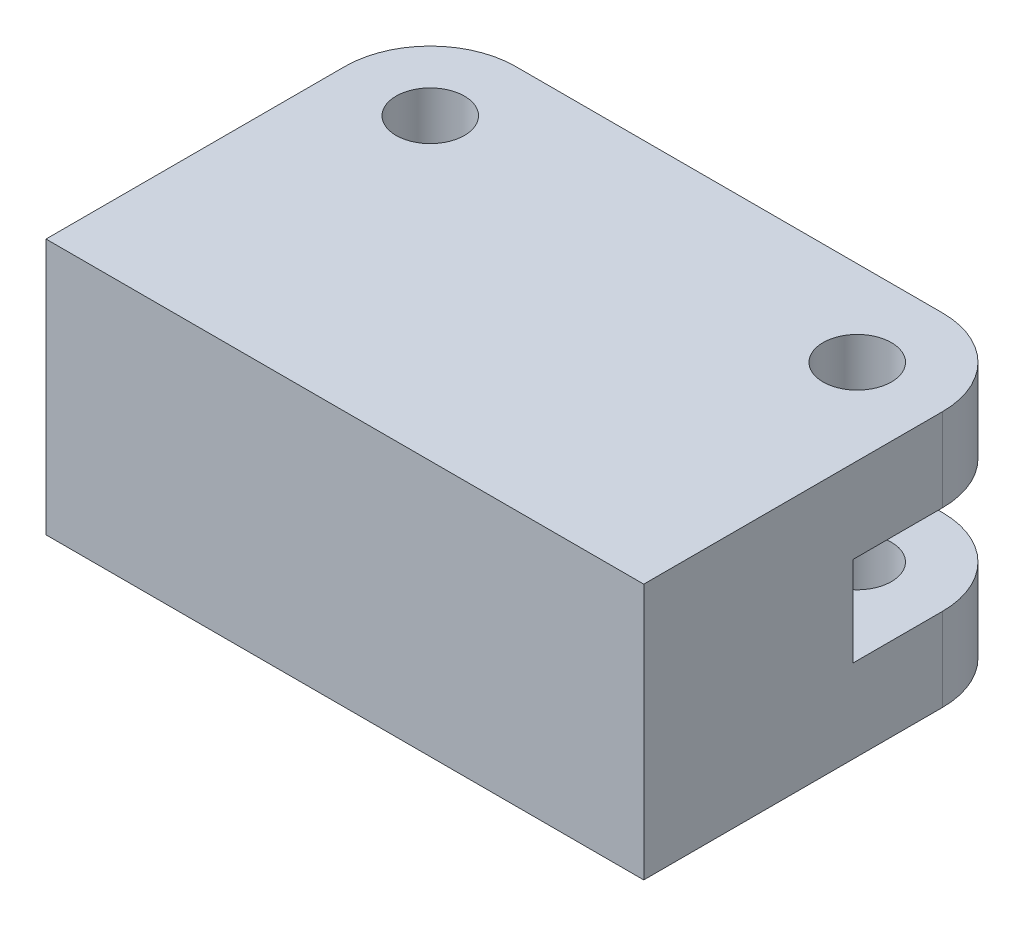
ISO-10303-21;
HEADER;
FILE_DESCRIPTION(('STEP AP214'),'2;1');
FILE_NAME('part.step','',(''),(''),'','','');
FILE_SCHEMA(('AUTOMOTIVE_DESIGN { 1 0 10303 214 1 1 1 1 }'));
ENDSEC;
DATA;
#1=APPLICATION_CONTEXT('core data for automotive mechanical design processes');
#2=APPLICATION_PROTOCOL_DEFINITION('international standard','automotive_design',2000,#1);
#3=PRODUCT_CONTEXT('',#1,'mechanical');
#4=PRODUCT('Part','Part','',(#3));
#5=PRODUCT_RELATED_PRODUCT_CATEGORY('part','',(#4));
#6=PRODUCT_DEFINITION_FORMATION('','',#4);
#7=PRODUCT_DEFINITION_CONTEXT('part definition',#1,'design');
#8=PRODUCT_DEFINITION('design','',#6,#7);
#9=PRODUCT_DEFINITION_SHAPE('','',#8);
#10=(LENGTH_UNIT() NAMED_UNIT(*) SI_UNIT(.MILLI.,.METRE.));
#11=(NAMED_UNIT(*) PLANE_ANGLE_UNIT() SI_UNIT($,.RADIAN.));
#12=(NAMED_UNIT(*) SI_UNIT($,.STERADIAN.) SOLID_ANGLE_UNIT());
#13=UNCERTAINTY_MEASURE_WITH_UNIT(LENGTH_MEASURE(1.E-05),#10,'distance_accuracy_value','');
#14=(GEOMETRIC_REPRESENTATION_CONTEXT(3) GLOBAL_UNCERTAINTY_ASSIGNED_CONTEXT((#13)) GLOBAL_UNIT_ASSIGNED_CONTEXT((#10,
#11,#12)) REPRESENTATION_CONTEXT('',''));
#15=CARTESIAN_POINT('',(0.,0.,0.));
#16=DIRECTION('',(0.,0.,1.));
#17=DIRECTION('',(1.,0.,0.));
#18=AXIS2_PLACEMENT_3D('',#15,#16,#17);
#19=CARTESIAN_POINT('',(0.,12.,0.));
#20=DIRECTION('',(0.,0.,1.));
#21=DIRECTION('',(1.,0.,0.));
#22=AXIS2_PLACEMENT_3D('',#19,#20,#21);
#23=PLANE('',#22);
#24=DIRECTION('',(-1.,0.,0.));
#25=VECTOR('',#24,1.);
#26=CARTESIAN_POINT('',(0.,12.,0.));
#27=LINE('',#26,#25);
#28=CARTESIAN_POINT('',(24.,12.,0.));
#29=VERTEX_POINT('',#28);
#30=CARTESIAN_POINT('',(4.,12.,0.));
#31=VERTEX_POINT('',#30);
#32=EDGE_CURVE('E192',#29,#31,#27,.T.);
#33=ORIENTED_EDGE('',*,*,#32,.F.);
#34=DIRECTION('',(0.,-1.,0.));
#35=VECTOR('',#34,1.);
#36=CARTESIAN_POINT('',(24.,12.,0.));
#37=LINE('',#36,#35);
#38=CARTESIAN_POINT('',(24.,8.1,0.));
#39=VERTEX_POINT('',#38);
#40=EDGE_CURVE('E230',#29,#39,#37,.T.);
#41=ORIENTED_EDGE('',*,*,#40,.T.);
#42=DIRECTION('',(1.,0.,0.));
#43=VECTOR('',#42,1.);
#44=CARTESIAN_POINT('',(28.,8.1,0.));
#45=LINE('',#44,#43);
#46=CARTESIAN_POINT('',(4.00000000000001,8.1,0.));
#47=VERTEX_POINT('',#46);
#48=EDGE_CURVE('E151',#47,#39,#45,.T.);
#49=ORIENTED_EDGE('',*,*,#48,.F.);
#50=DIRECTION('',(0.,-1.,0.));
#51=VECTOR('',#50,1.);
#52=CARTESIAN_POINT('',(4.,12.,0.));
#53=LINE('',#52,#51);
#54=EDGE_CURVE('E228',#47,#31,#53,.F.);
#55=ORIENTED_EDGE('',*,*,#54,.T.);
#56=EDGE_LOOP('',(#33,#41,#49,#55));
#57=FACE_BOUND('',#56,.T.);
#58=ADVANCED_FACE('F41',(#57),#23,.F.);
#59=CARTESIAN_POINT('',(4.,12.,4.));
#60=DIRECTION('',(0.,-1.,0.));
#61=DIRECTION('',(0.,0.,-1.));
#62=AXIS2_PLACEMENT_3D('',#59,#60,#61);
#63=CYLINDRICAL_SURFACE('',#62,1.6);
#64=CARTESIAN_POINT('',(4.,8.1,4.));
#65=DIRECTION('',(0.,1.,0.));
#66=DIRECTION('',(0.,0.,1.));
#67=AXIS2_PLACEMENT_3D('',#64,#65,#66);
#68=CIRCLE('',#67,1.6);
#69=CARTESIAN_POINT('',(4.,8.1,5.6));
#70=VERTEX_POINT('',#69);
#71=EDGE_CURVE('E168',#70,#70,#68,.T.);
#72=ORIENTED_EDGE('',*,*,#71,.F.);
#73=EDGE_LOOP('',(#72));
#74=FACE_BOUND('',#73,.T.);
#75=CARTESIAN_POINT('',(4.,12.,4.));
#76=DIRECTION('',(0.,1.,0.));
#77=DIRECTION('',(0.,0.,1.));
#78=AXIS2_PLACEMENT_3D('',#75,#76,#77);
#79=CIRCLE('',#78,1.6);
#80=CARTESIAN_POINT('',(4.,12.,5.6));
#81=VERTEX_POINT('',#80);
#82=EDGE_CURVE('E178',#81,#81,#79,.T.);
#83=ORIENTED_EDGE('',*,*,#82,.T.);
#84=EDGE_LOOP('',(#83));
#85=FACE_BOUND('',#84,.T.);
#86=ADVANCED_FACE('F291',(#74,#85),#63,.F.);
#87=CARTESIAN_POINT('',(24.,12.,4.));
#88=DIRECTION('',(0.,-1.,0.));
#89=DIRECTION('',(0.,0.,-1.));
#90=AXIS2_PLACEMENT_3D('',#87,#88,#89);
#91=CYLINDRICAL_SURFACE('',#90,1.6);
#92=CARTESIAN_POINT('',(24.,8.1,4.));
#93=DIRECTION('',(0.,1.,0.));
#94=DIRECTION('',(0.,0.,1.));
#95=AXIS2_PLACEMENT_3D('',#92,#93,#94);
#96=CIRCLE('',#95,1.6);
#97=CARTESIAN_POINT('',(24.,8.1,5.6));
#98=VERTEX_POINT('',#97);
#99=EDGE_CURVE('E166',#98,#98,#96,.T.);
#100=ORIENTED_EDGE('',*,*,#99,.F.);
#101=EDGE_LOOP('',(#100));
#102=FACE_BOUND('',#101,.T.);
#103=CARTESIAN_POINT('',(24.,12.,4.));
#104=DIRECTION('',(0.,1.,0.));
#105=DIRECTION('',(0.,0.,1.));
#106=AXIS2_PLACEMENT_3D('',#103,#104,#105);
#107=CIRCLE('',#106,1.6);
#108=CARTESIAN_POINT('',(24.,12.,5.6));
#109=VERTEX_POINT('',#108);
#110=EDGE_CURVE('E172',#109,#109,#107,.T.);
#111=ORIENTED_EDGE('',*,*,#110,.T.);
#112=EDGE_LOOP('',(#111));
#113=FACE_BOUND('',#112,.T.);
#114=ADVANCED_FACE('F298',(#102,#113),#91,.F.);
#115=CARTESIAN_POINT('',(0.,12.,0.));
#116=DIRECTION('',(0.,1.,0.));
#117=DIRECTION('',(0.,0.,1.));
#118=AXIS2_PLACEMENT_3D('',#115,#116,#117);
#119=PLANE('',#118);
#120=ORIENTED_EDGE('',*,*,#82,.F.);
#121=EDGE_LOOP('',(#120));
#122=FACE_BOUND('',#121,.T.);
#123=DIRECTION('',(0.,0.,-1.));
#124=VECTOR('',#123,1.);
#125=CARTESIAN_POINT('',(28.,12.,0.));
#126=LINE('',#125,#124);
#127=CARTESIAN_POINT('',(28.,12.,18.));
#128=VERTEX_POINT('',#127);
#129=CARTESIAN_POINT('',(28.,12.,4.));
#130=VERTEX_POINT('',#129);
#131=EDGE_CURVE('E189',#128,#130,#126,.T.);
#132=ORIENTED_EDGE('',*,*,#131,.T.);
#133=CARTESIAN_POINT('',(24.,12.,4.));
#134=DIRECTION('',(0.,1.,0.));
#135=DIRECTION('',(0.,0.,1.));
#136=AXIS2_PLACEMENT_3D('',#133,#134,#135);
#137=CIRCLE('',#136,4.);
#138=EDGE_CURVE('E237',#130,#29,#137,.T.);
#139=ORIENTED_EDGE('',*,*,#138,.T.);
#140=ORIENTED_EDGE('',*,*,#32,.T.);
#141=CARTESIAN_POINT('',(4.,12.,4.));
#142=DIRECTION('',(0.,1.,0.));
#143=DIRECTION('',(0.,0.,1.));
#144=AXIS2_PLACEMENT_3D('',#141,#142,#143);
#145=CIRCLE('',#144,4.);
#146=CARTESIAN_POINT('',(0.,12.,4.));
#147=VERTEX_POINT('',#146);
#148=EDGE_CURVE('E56',#31,#147,#145,.T.);
#149=ORIENTED_EDGE('',*,*,#148,.T.);
#150=DIRECTION('',(0.,0.,1.));
#151=VECTOR('',#150,1.);
#152=CARTESIAN_POINT('',(0.,12.,0.));
#153=LINE('',#152,#151);
#154=CARTESIAN_POINT('',(0.,12.,18.));
#155=VERTEX_POINT('',#154);
#156=EDGE_CURVE('E184',#147,#155,#153,.T.);
#157=ORIENTED_EDGE('',*,*,#156,.T.);
#158=DIRECTION('',(1.,0.,0.));
#159=VECTOR('',#158,1.);
#160=CARTESIAN_POINT('',(0.,12.,18.));
#161=LINE('',#160,#159);
#162=EDGE_CURVE('E186',#155,#128,#161,.T.);
#163=ORIENTED_EDGE('',*,*,#162,.T.);
#164=EDGE_LOOP('',(#132,#139,#140,#149,#157,#163));
#165=FACE_BOUND('',#164,.T.);
#166=ORIENTED_EDGE('',*,*,#110,.F.);
#167=EDGE_LOOP('',(#166));
#168=FACE_BOUND('',#167,.T.);
#169=ADVANCED_FACE('F264',(#122,#165,#168),#119,.T.);
#170=CARTESIAN_POINT('',(0.,0.,0.));
#171=DIRECTION('',(0.,1.,0.));
#172=DIRECTION('',(0.,0.,1.));
#173=AXIS2_PLACEMENT_3D('',#170,#171,#172);
#174=PLANE('',#173);
#175=DIRECTION('',(-1.,0.,0.));
#176=VECTOR('',#175,1.);
#177=CARTESIAN_POINT('',(0.,0.,0.));
#178=LINE('',#177,#176);
#179=CARTESIAN_POINT('',(24.,0.,0.));
#180=VERTEX_POINT('',#179);
#181=CARTESIAN_POINT('',(4.,0.,0.));
#182=VERTEX_POINT('',#181);
#183=EDGE_CURVE('E187',#180,#182,#178,.T.);
#184=ORIENTED_EDGE('',*,*,#183,.F.);
#185=CARTESIAN_POINT('',(24.,0.,4.));
#186=DIRECTION('',(0.,1.,0.));
#187=DIRECTION('',(0.,0.,1.));
#188=AXIS2_PLACEMENT_3D('',#185,#186,#187);
#189=CIRCLE('',#188,4.);
#190=CARTESIAN_POINT('',(28.,0.,4.));
#191=VERTEX_POINT('',#190);
#192=EDGE_CURVE('E219',#180,#191,#189,.F.);
#193=ORIENTED_EDGE('',*,*,#192,.T.);
#194=DIRECTION('',(0.,0.,-1.));
#195=VECTOR('',#194,1.);
#196=CARTESIAN_POINT('',(28.,0.,0.));
#197=LINE('',#196,#195);
#198=CARTESIAN_POINT('',(28.,0.,18.));
#199=VERTEX_POINT('',#198);
#200=EDGE_CURVE('E198',#199,#191,#197,.T.);
#201=ORIENTED_EDGE('',*,*,#200,.F.);
#202=DIRECTION('',(1.,0.,0.));
#203=VECTOR('',#202,1.);
#204=CARTESIAN_POINT('',(0.,0.,18.));
#205=LINE('',#204,#203);
#206=CARTESIAN_POINT('',(0.,0.,18.));
#207=VERTEX_POINT('',#206);
#208=EDGE_CURVE('E196',#207,#199,#205,.T.);
#209=ORIENTED_EDGE('',*,*,#208,.F.);
#210=DIRECTION('',(0.,0.,1.));
#211=VECTOR('',#210,1.);
#212=CARTESIAN_POINT('',(0.,0.,0.));
#213=LINE('',#212,#211);
#214=CARTESIAN_POINT('',(0.,0.,4.));
#215=VERTEX_POINT('',#214);
#216=EDGE_CURVE('E181',#215,#207,#213,.T.);
#217=ORIENTED_EDGE('',*,*,#216,.F.);
#218=CARTESIAN_POINT('',(4.,0.,4.));
#219=DIRECTION('',(0.,1.,0.));
#220=DIRECTION('',(0.,0.,1.));
#221=AXIS2_PLACEMENT_3D('',#218,#219,#220);
#222=CIRCLE('',#221,4.);
#223=EDGE_CURVE('E217',#215,#182,#222,.F.);
#224=ORIENTED_EDGE('',*,*,#223,.T.);
#225=EDGE_LOOP('',(#184,#193,#201,#209,#217,#224));
#226=FACE_BOUND('',#225,.T.);
#227=CARTESIAN_POINT('',(4.,0.,4.));
#228=DIRECTION('',(0.,1.,0.));
#229=DIRECTION('',(0.,0.,1.));
#230=AXIS2_PLACEMENT_3D('',#227,#228,#229);
#231=CIRCLE('',#230,1.6);
#232=CARTESIAN_POINT('',(4.,0.,5.6));
#233=VERTEX_POINT('',#232);
#234=EDGE_CURVE('E175',#233,#233,#231,.T.);
#235=ORIENTED_EDGE('',*,*,#234,.T.);
#236=EDGE_LOOP('',(#235));
#237=FACE_BOUND('',#236,.T.);
#238=CARTESIAN_POINT('',(24.,0.,4.));
#239=DIRECTION('',(0.,1.,0.));
#240=DIRECTION('',(0.,0.,1.));
#241=AXIS2_PLACEMENT_3D('',#238,#239,#240);
#242=CIRCLE('',#241,1.6);
#243=CARTESIAN_POINT('',(24.,0.,5.6));
#244=VERTEX_POINT('',#243);
#245=EDGE_CURVE('E171',#244,#244,#242,.T.);
#246=ORIENTED_EDGE('',*,*,#245,.T.);
#247=EDGE_LOOP('',(#246));
#248=FACE_BOUND('',#247,.T.);
#249=ADVANCED_FACE('F249',(#226,#237,#248),#174,.F.);
#250=CARTESIAN_POINT('',(0.,12.,0.));
#251=DIRECTION('',(1.,0.,0.));
#252=DIRECTION('',(0.,0.,-1.));
#253=AXIS2_PLACEMENT_3D('',#250,#251,#252);
#254=PLANE('',#253);
#255=ORIENTED_EDGE('',*,*,#156,.F.);
#256=DIRECTION('',(0.,-1.,0.));
#257=VECTOR('',#256,1.);
#258=CARTESIAN_POINT('',(0.,12.,4.));
#259=LINE('',#258,#257);
#260=CARTESIAN_POINT('',(0.,8.1,4.));
#261=VERTEX_POINT('',#260);
#262=EDGE_CURVE('E11',#147,#261,#259,.T.);
#263=ORIENTED_EDGE('',*,*,#262,.T.);
#264=DIRECTION('',(0.,0.,-1.));
#265=VECTOR('',#264,1.);
#266=CARTESIAN_POINT('',(0.,8.1,8.2));
#267=LINE('',#266,#265);
#268=CARTESIAN_POINT('',(0.,8.1,8.2));
#269=VERTEX_POINT('',#268);
#270=EDGE_CURVE('E158',#269,#261,#267,.T.);
#271=ORIENTED_EDGE('',*,*,#270,.F.);
#272=DIRECTION('',(0.,1.,0.));
#273=VECTOR('',#272,1.);
#274=CARTESIAN_POINT('',(0.,8.1,8.2));
#275=LINE('',#274,#273);
#276=CARTESIAN_POINT('',(0.,3.9,8.2));
#277=VERTEX_POINT('',#276);
#278=EDGE_CURVE('E141',#277,#269,#275,.T.);
#279=ORIENTED_EDGE('',*,*,#278,.F.);
#280=DIRECTION('',(0.,0.,-1.));
#281=VECTOR('',#280,1.);
#282=CARTESIAN_POINT('',(0.,3.9,8.2));
#283=LINE('',#282,#281);
#284=CARTESIAN_POINT('',(0.,3.9,4.));
#285=VERTEX_POINT('',#284);
#286=EDGE_CURVE('E138',#277,#285,#283,.T.);
#287=ORIENTED_EDGE('',*,*,#286,.T.);
#288=DIRECTION('',(0.,-1.,0.));
#289=VECTOR('',#288,1.);
#290=CARTESIAN_POINT('',(0.,12.,4.));
#291=LINE('',#290,#289);
#292=EDGE_CURVE('E49',#285,#215,#291,.T.);
#293=ORIENTED_EDGE('',*,*,#292,.T.);
#294=ORIENTED_EDGE('',*,*,#216,.T.);
#295=DIRECTION('',(0.,-1.,0.));
#296=VECTOR('',#295,1.);
#297=CARTESIAN_POINT('',(0.,12.,18.));
#298=LINE('',#297,#296);
#299=EDGE_CURVE('E204',#155,#207,#298,.T.);
#300=ORIENTED_EDGE('',*,*,#299,.F.);
#301=EDGE_LOOP('',(#255,#263,#271,#279,#287,#293,#294,#300));
#302=FACE_BOUND('',#301,.T.);
#303=ADVANCED_FACE('F242',(#302),#254,.F.);
#304=CARTESIAN_POINT('',(0.,12.,18.));
#305=DIRECTION('',(0.,0.,-1.));
#306=DIRECTION('',(-1.,0.,0.));
#307=AXIS2_PLACEMENT_3D('',#304,#305,#306);
#308=PLANE('',#307);
#309=ORIENTED_EDGE('',*,*,#208,.T.);
#310=DIRECTION('',(0.,-1.,0.));
#311=VECTOR('',#310,1.);
#312=CARTESIAN_POINT('',(28.,12.,18.));
#313=LINE('',#312,#311);
#314=EDGE_CURVE('E194',#128,#199,#313,.T.);
#315=ORIENTED_EDGE('',*,*,#314,.F.);
#316=ORIENTED_EDGE('',*,*,#162,.F.);
#317=ORIENTED_EDGE('',*,*,#299,.T.);
#318=EDGE_LOOP('',(#309,#315,#316,#317));
#319=FACE_BOUND('',#318,.T.);
#320=ADVANCED_FACE('F255',(#319),#308,.F.);
#321=CARTESIAN_POINT('',(28.,12.,0.));
#322=DIRECTION('',(-1.,0.,0.));
#323=DIRECTION('',(0.,0.,1.));
#324=AXIS2_PLACEMENT_3D('',#321,#322,#323);
#325=PLANE('',#324);
#326=ORIENTED_EDGE('',*,*,#200,.T.);
#327=DIRECTION('',(0.,-1.,0.));
#328=VECTOR('',#327,1.);
#329=CARTESIAN_POINT('',(28.,12.,4.));
#330=LINE('',#329,#328);
#331=CARTESIAN_POINT('',(28.,3.9,4.));
#332=VERTEX_POINT('',#331);
#333=EDGE_CURVE('E156',#191,#332,#330,.F.);
#334=ORIENTED_EDGE('',*,*,#333,.T.);
#335=DIRECTION('',(0.,0.,-1.));
#336=VECTOR('',#335,1.);
#337=CARTESIAN_POINT('',(28.,3.9,8.2));
#338=LINE('',#337,#336);
#339=CARTESIAN_POINT('',(28.,3.9,8.2));
#340=VERTEX_POINT('',#339);
#341=EDGE_CURVE('E135',#340,#332,#338,.T.);
#342=ORIENTED_EDGE('',*,*,#341,.F.);
#343=DIRECTION('',(0.,-1.,0.));
#344=VECTOR('',#343,1.);
#345=CARTESIAN_POINT('',(28.,8.1,8.2));
#346=LINE('',#345,#344);
#347=CARTESIAN_POINT('',(28.,8.1,8.2));
#348=VERTEX_POINT('',#347);
#349=EDGE_CURVE('E142',#348,#340,#346,.T.);
#350=ORIENTED_EDGE('',*,*,#349,.F.);
#351=DIRECTION('',(0.,0.,-1.));
#352=VECTOR('',#351,1.);
#353=CARTESIAN_POINT('',(28.,8.1,8.2));
#354=LINE('',#353,#352);
#355=CARTESIAN_POINT('',(28.,8.1,4.));
#356=VERTEX_POINT('',#355);
#357=EDGE_CURVE('E210',#348,#356,#354,.T.);
#358=ORIENTED_EDGE('',*,*,#357,.T.);
#359=DIRECTION('',(0.,-1.,0.));
#360=VECTOR('',#359,1.);
#361=CARTESIAN_POINT('',(28.,12.,4.));
#362=LINE('',#361,#360);
#363=EDGE_CURVE('E221',#356,#130,#362,.F.);
#364=ORIENTED_EDGE('',*,*,#363,.T.);
#365=ORIENTED_EDGE('',*,*,#131,.F.);
#366=ORIENTED_EDGE('',*,*,#314,.T.);
#367=EDGE_LOOP('',(#326,#334,#342,#350,#358,#364,#365,#366));
#368=FACE_BOUND('',#367,.T.);
#369=ADVANCED_FACE('F154',(#368),#325,.F.);
#370=DIRECTION('',(-1.,0.,0.));
#371=VECTOR('',#370,1.);
#372=CARTESIAN_POINT('',(28.,3.9,0.));
#373=LINE('',#372,#371);
#374=CARTESIAN_POINT('',(24.,3.9,0.));
#375=VERTEX_POINT('',#374);
#376=CARTESIAN_POINT('',(4.00000000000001,3.9,0.));
#377=VERTEX_POINT('',#376);
#378=EDGE_CURVE('E273',#375,#377,#373,.T.);
#379=ORIENTED_EDGE('',*,*,#378,.F.);
#380=DIRECTION('',(0.,-1.,0.));
#381=VECTOR('',#380,1.);
#382=CARTESIAN_POINT('',(24.,12.,0.));
#383=LINE('',#382,#381);
#384=EDGE_CURVE('E214',#375,#180,#383,.T.);
#385=ORIENTED_EDGE('',*,*,#384,.T.);
#386=ORIENTED_EDGE('',*,*,#183,.T.);
#387=DIRECTION('',(0.,-1.,0.));
#388=VECTOR('',#387,1.);
#389=CARTESIAN_POINT('',(4.,12.,0.));
#390=LINE('',#389,#388);
#391=EDGE_CURVE('E207',#182,#377,#390,.F.);
#392=ORIENTED_EDGE('',*,*,#391,.T.);
#393=EDGE_LOOP('',(#379,#385,#386,#392));
#394=FACE_BOUND('',#393,.T.);
#395=ADVANCED_FACE('F284',(#394),#23,.F.);
#396=CARTESIAN_POINT('',(4.,3.9,4.));
#397=DIRECTION('',(0.,-1.,0.));
#398=DIRECTION('',(0.,0.,-1.));
#399=AXIS2_PLACEMENT_3D('',#396,#397,#398);
#400=CIRCLE('',#399,1.6);
#401=CARTESIAN_POINT('',(4.,3.9,2.4));
#402=VERTEX_POINT('',#401);
#403=EDGE_CURVE('E163',#402,#402,#400,.T.);
#404=ORIENTED_EDGE('',*,*,#403,.F.);
#405=EDGE_LOOP('',(#404));
#406=FACE_BOUND('',#405,.T.);
#407=ORIENTED_EDGE('',*,*,#234,.F.);
#408=EDGE_LOOP('',(#407));
#409=FACE_BOUND('',#408,.T.);
#410=ADVANCED_FACE('F301',(#406,#409),#63,.F.);
#411=CARTESIAN_POINT('',(24.,3.9,4.));
#412=DIRECTION('',(0.,-1.,0.));
#413=DIRECTION('',(0.,0.,-1.));
#414=AXIS2_PLACEMENT_3D('',#411,#412,#413);
#415=CIRCLE('',#414,1.6);
#416=CARTESIAN_POINT('',(24.,3.9,2.4));
#417=VERTEX_POINT('',#416);
#418=EDGE_CURVE('E167',#417,#417,#415,.T.);
#419=ORIENTED_EDGE('',*,*,#418,.F.);
#420=EDGE_LOOP('',(#419));
#421=FACE_BOUND('',#420,.T.);
#422=ORIENTED_EDGE('',*,*,#245,.F.);
#423=EDGE_LOOP('',(#422));
#424=FACE_BOUND('',#423,.T.);
#425=ADVANCED_FACE('F310',(#421,#424),#91,.F.);
#426=CARTESIAN_POINT('',(28.,8.1,8.2));
#427=DIRECTION('',(0.,1.,0.));
#428=DIRECTION('',(0.,0.,1.));
#429=AXIS2_PLACEMENT_3D('',#426,#427,#428);
#430=PLANE('',#429);
#431=ORIENTED_EDGE('',*,*,#71,.T.);
#432=EDGE_LOOP('',(#431));
#433=FACE_BOUND('',#432,.T.);
#434=ORIENTED_EDGE('',*,*,#99,.T.);
#435=EDGE_LOOP('',(#434));
#436=FACE_BOUND('',#435,.T.);
#437=ORIENTED_EDGE('',*,*,#48,.T.);
#438=CARTESIAN_POINT('',(24.,8.1,4.));
#439=DIRECTION('',(0.,1.,0.));
#440=DIRECTION('',(0.,0.,1.));
#441=AXIS2_PLACEMENT_3D('',#438,#439,#440);
#442=CIRCLE('',#441,4.);
#443=EDGE_CURVE('E234',#39,#356,#442,.F.);
#444=ORIENTED_EDGE('',*,*,#443,.T.);
#445=ORIENTED_EDGE('',*,*,#357,.F.);
#446=DIRECTION('',(1.,0.,0.));
#447=VECTOR('',#446,1.);
#448=CARTESIAN_POINT('',(28.,8.1,8.2));
#449=LINE('',#448,#447);
#450=EDGE_CURVE('E148',#269,#348,#449,.T.);
#451=ORIENTED_EDGE('',*,*,#450,.F.);
#452=ORIENTED_EDGE('',*,*,#270,.T.);
#453=CARTESIAN_POINT('',(4.,8.1,4.));
#454=DIRECTION('',(0.,1.,0.));
#455=DIRECTION('',(0.,0.,1.));
#456=AXIS2_PLACEMENT_3D('',#453,#454,#455);
#457=CIRCLE('',#456,4.);
#458=EDGE_CURVE('E64',#261,#47,#457,.F.);
#459=ORIENTED_EDGE('',*,*,#458,.T.);
#460=EDGE_LOOP('',(#437,#444,#445,#451,#452,#459));
#461=FACE_BOUND('',#460,.T.);
#462=ADVANCED_FACE('F272',(#433,#436,#461),#430,.F.);
#463=CARTESIAN_POINT('',(28.,3.9,8.2));
#464=DIRECTION('',(0.,-1.,0.));
#465=DIRECTION('',(0.,0.,-1.));
#466=AXIS2_PLACEMENT_3D('',#463,#464,#465);
#467=PLANE('',#466);
#468=ORIENTED_EDGE('',*,*,#403,.T.);
#469=EDGE_LOOP('',(#468));
#470=FACE_BOUND('',#469,.T.);
#471=ORIENTED_EDGE('',*,*,#418,.T.);
#472=EDGE_LOOP('',(#471));
#473=FACE_BOUND('',#472,.T.);
#474=ORIENTED_EDGE('',*,*,#341,.T.);
#475=CARTESIAN_POINT('',(24.,3.9,4.));
#476=DIRECTION('',(0.,-1.,0.));
#477=DIRECTION('',(0.,0.,-1.));
#478=AXIS2_PLACEMENT_3D('',#475,#476,#477);
#479=CIRCLE('',#478,4.);
#480=EDGE_CURVE('E226',#332,#375,#479,.F.);
#481=ORIENTED_EDGE('',*,*,#480,.T.);
#482=ORIENTED_EDGE('',*,*,#378,.T.);
#483=CARTESIAN_POINT('',(4.,3.9,4.));
#484=DIRECTION('',(0.,-1.,0.));
#485=DIRECTION('',(0.,0.,-1.));
#486=AXIS2_PLACEMENT_3D('',#483,#484,#485);
#487=CIRCLE('',#486,4.);
#488=EDGE_CURVE('E224',#377,#285,#487,.F.);
#489=ORIENTED_EDGE('',*,*,#488,.T.);
#490=ORIENTED_EDGE('',*,*,#286,.F.);
#491=DIRECTION('',(-1.,0.,0.));
#492=VECTOR('',#491,1.);
#493=CARTESIAN_POINT('',(28.,3.9,8.2));
#494=LINE('',#493,#492);
#495=EDGE_CURVE('E131',#340,#277,#494,.T.);
#496=ORIENTED_EDGE('',*,*,#495,.F.);
#497=EDGE_LOOP('',(#474,#481,#482,#489,#490,#496));
#498=FACE_BOUND('',#497,.T.);
#499=ADVANCED_FACE('F133',(#470,#473,#498),#467,.F.);
#500=CARTESIAN_POINT('',(0.,0.,8.2));
#501=DIRECTION('',(0.,0.,-1.));
#502=DIRECTION('',(-1.,0.,0.));
#503=AXIS2_PLACEMENT_3D('',#500,#501,#502);
#504=PLANE('',#503);
#505=ORIENTED_EDGE('',*,*,#349,.T.);
#506=ORIENTED_EDGE('',*,*,#495,.T.);
#507=ORIENTED_EDGE('',*,*,#278,.T.);
#508=ORIENTED_EDGE('',*,*,#450,.T.);
#509=EDGE_LOOP('',(#505,#506,#507,#508));
#510=FACE_BOUND('',#509,.T.);
#511=ADVANCED_FACE('F146',(#510),#504,.T.);
#512=CARTESIAN_POINT('',(24.,12.,4.));
#513=DIRECTION('',(0.,-1.,0.));
#514=DIRECTION('',(0.,0.,-1.));
#515=AXIS2_PLACEMENT_3D('',#512,#513,#514);
#516=CYLINDRICAL_SURFACE('',#515,4.);
#517=ORIENTED_EDGE('',*,*,#480,.F.);
#518=ORIENTED_EDGE('',*,*,#333,.F.);
#519=ORIENTED_EDGE('',*,*,#192,.F.);
#520=ORIENTED_EDGE('',*,*,#384,.F.);
#521=EDGE_LOOP('',(#517,#518,#519,#520));
#522=FACE_BOUND('',#521,.T.);
#523=ADVANCED_FACE('F280',(#522),#516,.T.);
#524=CARTESIAN_POINT('',(24.,12.,4.));
#525=DIRECTION('',(0.,-1.,0.));
#526=DIRECTION('',(0.,0.,-1.));
#527=AXIS2_PLACEMENT_3D('',#524,#525,#526);
#528=CYLINDRICAL_SURFACE('',#527,4.);
#529=ORIENTED_EDGE('',*,*,#138,.F.);
#530=ORIENTED_EDGE('',*,*,#363,.F.);
#531=ORIENTED_EDGE('',*,*,#443,.F.);
#532=ORIENTED_EDGE('',*,*,#40,.F.);
#533=EDGE_LOOP('',(#529,#530,#531,#532));
#534=FACE_BOUND('',#533,.T.);
#535=ADVANCED_FACE('F270',(#534),#528,.T.);
#536=CARTESIAN_POINT('',(4.,12.,4.));
#537=DIRECTION('',(0.,-1.,0.));
#538=DIRECTION('',(0.,0.,-1.));
#539=AXIS2_PLACEMENT_3D('',#536,#537,#538);
#540=CYLINDRICAL_SURFACE('',#539,4.);
#541=ORIENTED_EDGE('',*,*,#148,.F.);
#542=ORIENTED_EDGE('',*,*,#54,.F.);
#543=ORIENTED_EDGE('',*,*,#458,.F.);
#544=ORIENTED_EDGE('',*,*,#262,.F.);
#545=EDGE_LOOP('',(#541,#542,#543,#544));
#546=FACE_BOUND('',#545,.T.);
#547=ADVANCED_FACE('F258',(#546),#540,.T.);
#548=CARTESIAN_POINT('',(4.,12.,4.));
#549=DIRECTION('',(0.,-1.,0.));
#550=DIRECTION('',(0.,0.,-1.));
#551=AXIS2_PLACEMENT_3D('',#548,#549,#550);
#552=CYLINDRICAL_SURFACE('',#551,4.);
#553=ORIENTED_EDGE('',*,*,#488,.F.);
#554=ORIENTED_EDGE('',*,*,#391,.F.);
#555=ORIENTED_EDGE('',*,*,#223,.F.);
#556=ORIENTED_EDGE('',*,*,#292,.F.);
#557=EDGE_LOOP('',(#553,#554,#555,#556));
#558=FACE_BOUND('',#557,.T.);
#559=ADVANCED_FACE('F43',(#558),#552,.T.);
#560=CLOSED_SHELL('',(#58,#86,#114,#169,#249,#303,#320,#369,#395,#410,#425,#462,#499,#511,#523,
#535,#547,#559));
#561=MANIFOLD_SOLID_BREP('B2',#560);
#562=ADVANCED_BREP_SHAPE_REPRESENTATION('',(#18,#561),#14);
#563=SHAPE_DEFINITION_REPRESENTATION(#9,#562);
ENDSEC;
END-ISO-10303-21;
